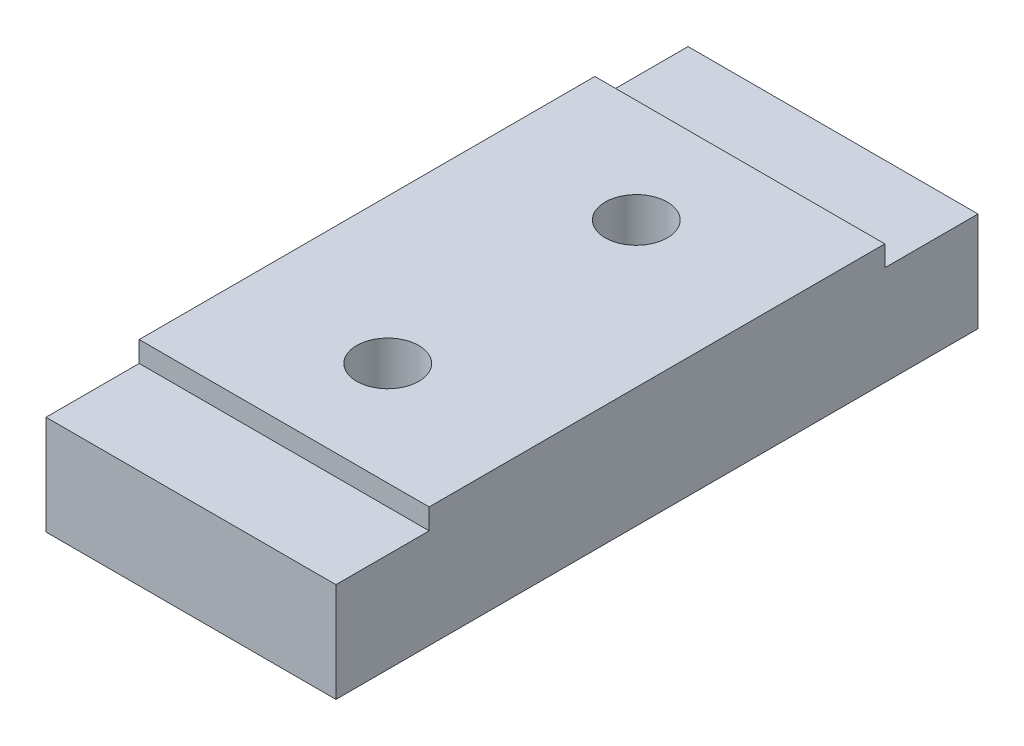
from build123d import *

# Parameters (mm, degrees)
EXTRUDE1_DEPTH                  = 15.5
EXTRUDE1_DEPTH_BACK             = 15.5
SKETCH1_W                       = 14
SKETCH1_H                       = 5.8
M3X0_5_TAPPED_HOLE1_D           = 2.5
M3X0_5_TAPPED_HOLE1_DEPTH       = 6.5
M3X0_5_TAPPED_HOLE1_CBORE_D     = 3
M3X0_5_TAPPED_HOLE1_CBORE_DEPTH = 5
SKETCH4_OUTSIDE_W               = 22.902
SKETCH4_OUTSIDE_H               = 39.902
SKETCH4_OUTSIDE_W_2             = 14
SKETCH4_OUTSIDE_H_2             = 22
CUT_EXTRUDE1_DEPTH              = 1


with BuildPart() as part:
    # Sketch1 → Extrude1 (new, two sides: drawn at the far end of the back side and taken through both)
    with BuildSketch(Plane.XY.offset(-EXTRUDE1_DEPTH_BACK)):
        with Locations((0, 6.1)):
            Rectangle(SKETCH1_W, SKETCH1_H)
    extrude(amount=EXTRUDE1_DEPTH + EXTRUDE1_DEPTH_BACK)

    # M3x0.5 Tapped Hole1
    with Locations(Plane(origin=(0, 9, 0), x_dir=(-1, 0, 0), z_dir=(0, 1, 0))):
        with Locations((0, 6)):
            m3x0_5_tapped_hole1 = CounterBoreHole(M3X0_5_TAPPED_HOLE1_D / 2, M3X0_5_TAPPED_HOLE1_CBORE_D / 2, M3X0_5_TAPPED_HOLE1_CBORE_DEPTH, depth=M3X0_5_TAPPED_HOLE1_DEPTH)

    # Mirror1: M3x0.5 Tapped Hole1 across plane
    add(m3x0_5_tapped_hole1.mirror(Plane.XY), mode=Mode.SUBTRACT)

    # Sketch4 outside → Cut-Extrude1 (cut)
    with BuildSketch(Plane(origin=(0, 9, 0), x_dir=(-1, 0, 0), z_dir=(0, 1, 0))):
        Rectangle(SKETCH4_OUTSIDE_W, SKETCH4_OUTSIDE_H)
        Rectangle(SKETCH4_OUTSIDE_W_2, SKETCH4_OUTSIDE_H_2, mode=Mode.SUBTRACT)
    extrude(amount=-CUT_EXTRUDE1_DEPTH, mode=Mode.SUBTRACT)


solid = part.part
